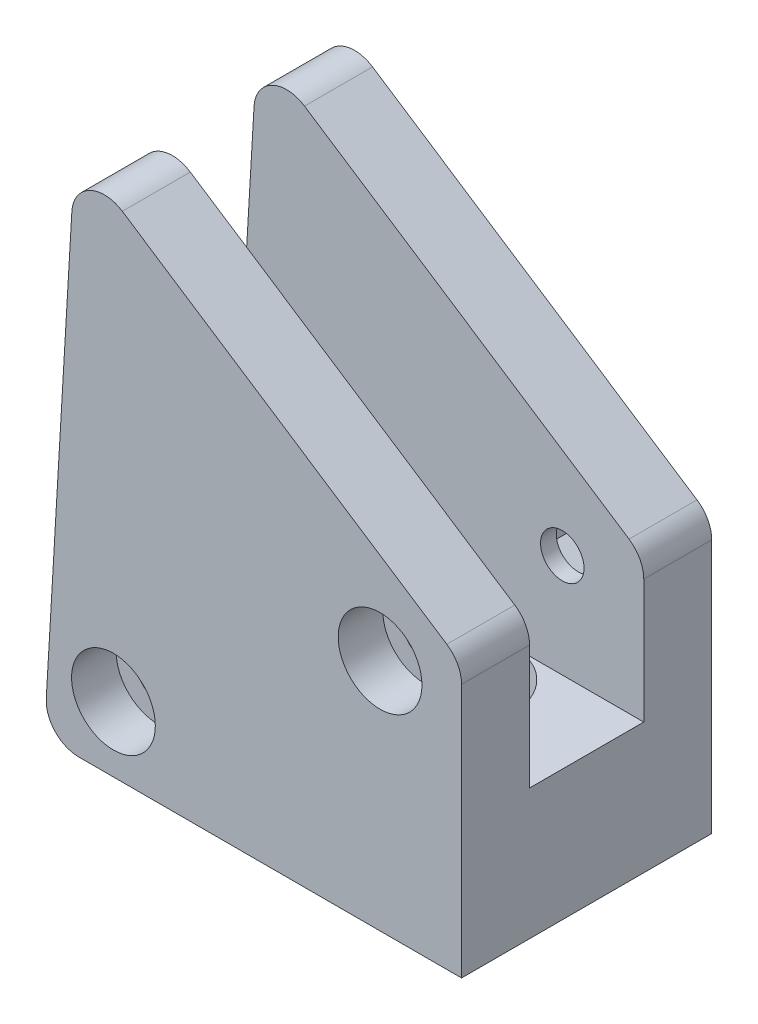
from build123d import *

# Parameters (mm, degrees)
ESQUISSE1_R             = 2
BOSS_EXTRU_1_DEPTH      = 11.5
ESQUISSE2_OUTSIDE_W     = 52.984
ESQUISSE2_OUTSIDE_H     = 60.737
ENL_V_MAT_EXTRU_1_DEPTH = 5.25
ESQUISSE3_R             = 5.25
ENL_V_MAT_EXTRU_2_DEPTH = 61.828625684
ESQUISSE4_R             = 3.85
ENL_V_MAT_EXTRU_3_DEPTH = 4.1
ENL_V_MAT_EXTRU_4_DEPTH = 4.8


with BuildPart() as part:
    # Esquisse1 → Boss.-Extru.1 (new, symmetric)
    with BuildSketch(Plane.XY):
        with BuildLine():
            Line((0, 0), (0, 23.379536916))
            ThreePointArc((0, 23.379536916), (-0.360454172, 24.805299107), (-1.35519855, 25.888446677))
            Line((-1.35519855, 25.888446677), (-31.183996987, 45.443733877))
            ThreePointArc((-31.183996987, 45.443733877), (-34.17627595, 45.615179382), (-35.823603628, 43.111294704))
            Line((-35.823603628, 43.111294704), (-38.176785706, 3.176470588))
            ThreePointArc((-38.176785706, 3.176470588), (-37.364801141, 0.942016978), (-35.181980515, 0))
            Line((-35.181980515, 0), (0, 0))
        make_face()
        with Locations((-32, 6)):
            Circle(ESQUISSE1_R, mode=Mode.SUBTRACT)
        with Locations((-7.489798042, 21.5)):
            Circle(ESQUISSE1_R, mode=Mode.SUBTRACT)
    extrude(amount=BOSS_EXTRU_1_DEPTH, both=True)

    # Esquisse2 outside → Enl_v. mat.-Extru.1 (cut, symmetric)
    with BuildSketch(Plane.XY):
        with Locations((-19.091, 22.9675)):
            Rectangle(ESQUISSE2_OUTSIDE_W, ESQUISSE2_OUTSIDE_H)
        with BuildLine():
            Line((0, 0), (-24, 0))
            Line((-24, 0), (-24, 9))
            ThreePointArc((-24, 9), (-23.121320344, 11.121320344), (-21, 12))
            Line((-21, 12), (0, 12))
            Line((0, 12), (0, 0))
        make_face(mode=Mode.SUBTRACT)
    extrude(amount=ENL_V_MAT_EXTRU_1_DEPTH, both=True, mode=Mode.SUBTRACT)

    # Esquisse3 → Enl_v. mat.-Extru.2 (cut, through all)
    with BuildSketch(Plane.XZ):
        with Locations(Location((-12, 0, 0), (0, 0, 270))):
            Circle(ESQUISSE3_R)
    extrude(amount=-ENL_V_MAT_EXTRU_2_DEPTH, mode=Mode.SUBTRACT)

    # Esquisse4 → Enl_v. mat.-Extru.3 (cut)
    with BuildSketch(Plane.XY.offset(11.5)):
        with Locations((-32, 6)):
            Circle(ESQUISSE4_R)
        with Locations((-7.489798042, 21.5)):
            Circle(ESQUISSE4_R)
    extrude(amount=-ENL_V_MAT_EXTRU_3_DEPTH, mode=Mode.SUBTRACT)

    # Esquisse5 → Enl_v. mat.-Extru.4 (cut)
    with BuildSketch(Plane(origin=(0, 0, -11.5), x_dir=(-1, 0, 0), z_dir=(0, 0, -1))):
        Polygon((7.509593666, 25.887817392), (3.699734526, 23.711052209), (3.679938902, 19.323234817), (7.470002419, 17.112182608), (11.279861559, 19.288947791), (11.299657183, 23.676765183), align=None)
        Polygon((32, 10.387862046), (28.2, 8.193931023), (28.2, 3.806068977), (32, 1.612137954), (35.8, 3.806068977), (35.8, 8.193931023), align=None)
    extrude(amount=-ENL_V_MAT_EXTRU_4_DEPTH, mode=Mode.SUBTRACT)


solid = part.part
